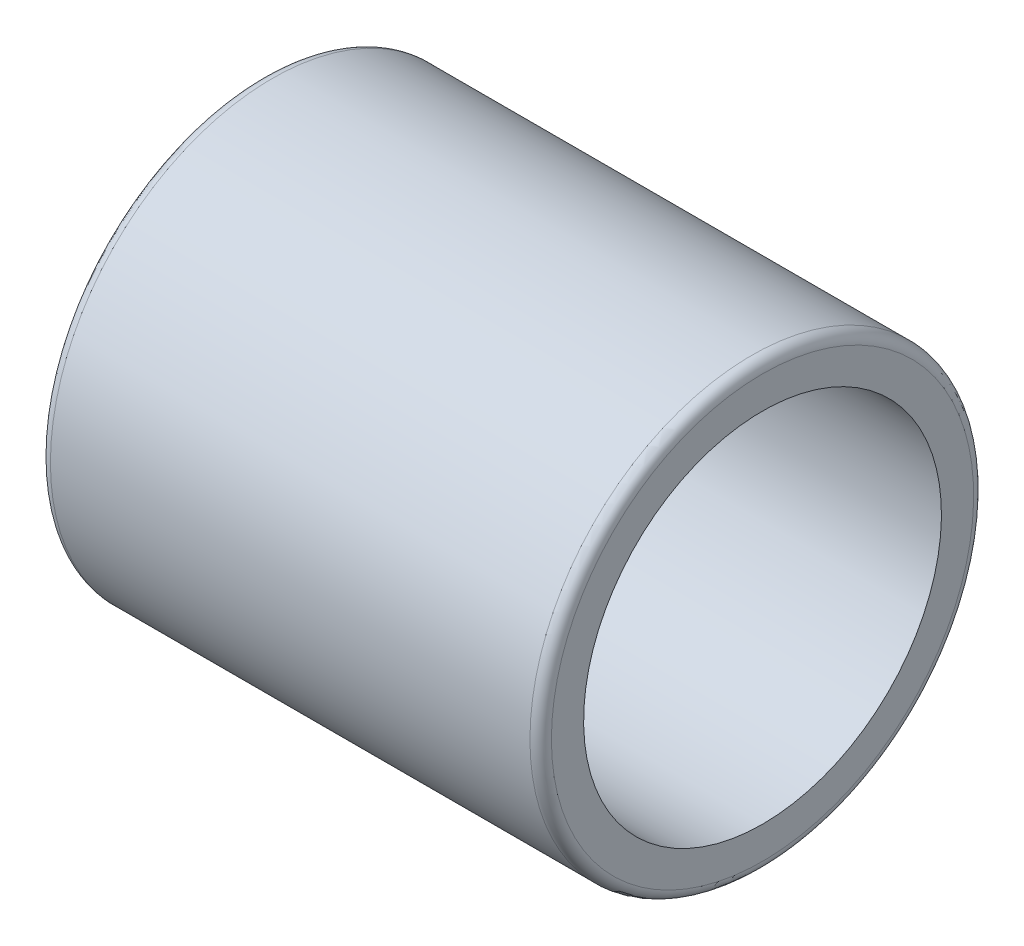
ISO-10303-21;
HEADER;
FILE_DESCRIPTION(('STEP AP214'),'2;1');
FILE_NAME('part.step','',(''),(''),'','','');
FILE_SCHEMA(('AUTOMOTIVE_DESIGN { 1 0 10303 214 1 1 1 1 }'));
ENDSEC;
DATA;
#1=APPLICATION_CONTEXT('core data for automotive mechanical design processes');
#2=APPLICATION_PROTOCOL_DEFINITION('international standard','automotive_design',2000,#1);
#3=PRODUCT_CONTEXT('',#1,'mechanical');
#4=PRODUCT('Part','Part','',(#3));
#5=PRODUCT_RELATED_PRODUCT_CATEGORY('part','',(#4));
#6=PRODUCT_DEFINITION_FORMATION('','',#4);
#7=PRODUCT_DEFINITION_CONTEXT('part definition',#1,'design');
#8=PRODUCT_DEFINITION('design','',#6,#7);
#9=PRODUCT_DEFINITION_SHAPE('','',#8);
#10=(LENGTH_UNIT() NAMED_UNIT(*) SI_UNIT(.MILLI.,.METRE.));
#11=(NAMED_UNIT(*) PLANE_ANGLE_UNIT() SI_UNIT($,.RADIAN.));
#12=(NAMED_UNIT(*) SI_UNIT($,.STERADIAN.) SOLID_ANGLE_UNIT());
#13=UNCERTAINTY_MEASURE_WITH_UNIT(LENGTH_MEASURE(1.E-05),#10,'distance_accuracy_value','');
#14=(GEOMETRIC_REPRESENTATION_CONTEXT(3) GLOBAL_UNCERTAINTY_ASSIGNED_CONTEXT((#13)) GLOBAL_UNIT_ASSIGNED_CONTEXT((#10,
#11,#12)) REPRESENTATION_CONTEXT('',''));
#15=CARTESIAN_POINT('',(0.,0.,0.));
#16=DIRECTION('',(0.,0.,1.));
#17=DIRECTION('',(1.,0.,0.));
#18=AXIS2_PLACEMENT_3D('',#15,#16,#17);
#19=CARTESIAN_POINT('',(0.,27.25,0.));
#20=DIRECTION('',(-1.,0.,0.));
#21=DIRECTION('',(0.,1.,0.));
#22=AXIS2_PLACEMENT_3D('',#19,#20,#21);
#23=PLANE('',#22);
#24=CARTESIAN_POINT('',(0.,0.,0.));
#25=DIRECTION('',(1.,0.,0.));
#26=DIRECTION('',(0.,1.,0.));
#27=AXIS2_PLACEMENT_3D('',#24,#25,#26);
#28=CIRCLE('',#27,25.);
#29=CARTESIAN_POINT('',(0.,-25.,0.));
#30=VERTEX_POINT('',#29);
#31=EDGE_CURVE('E85',#30,#30,#28,.T.);
#32=ORIENTED_EDGE('',*,*,#31,.T.);
#33=EDGE_LOOP('',(#32));
#34=FACE_BOUND('',#33,.T.);
#35=CARTESIAN_POINT('',(0.,0.,0.));
#36=DIRECTION('',(1.,0.,0.));
#37=DIRECTION('',(0.,1.,0.));
#38=AXIS2_PLACEMENT_3D('',#35,#36,#37);
#39=CIRCLE('',#38,29.5);
#40=CARTESIAN_POINT('',(0.,29.5,0.));
#41=VERTEX_POINT('',#40);
#42=CARTESIAN_POINT('',(0.,0.,29.5));
#43=VERTEX_POINT('',#42);
#44=EDGE_CURVE('E125',#41,#43,#39,.T.);
#45=ORIENTED_EDGE('',*,*,#44,.F.);
#46=CARTESIAN_POINT('',(0.,0.,0.));
#47=DIRECTION('',(1.,0.,0.));
#48=DIRECTION('',(0.,1.,0.));
#49=AXIS2_PLACEMENT_3D('',#46,#47,#48);
#50=CIRCLE('',#49,29.5);
#51=EDGE_CURVE('E120',#43,#41,#50,.T.);
#52=ORIENTED_EDGE('',*,*,#51,.F.);
#53=EDGE_LOOP('',(#45,#52));
#54=FACE_BOUND('',#53,.T.);
#55=ADVANCED_FACE('F16',(#34,#54),#23,.T.);
#56=CARTESIAN_POINT('',(70.,27.25,0.));
#57=DIRECTION('',(1.,0.,0.));
#58=DIRECTION('',(0.,1.,0.));
#59=AXIS2_PLACEMENT_3D('',#56,#57,#58);
#60=PLANE('',#59);
#61=CARTESIAN_POINT('',(70.,0.,0.));
#62=DIRECTION('',(1.,0.,0.));
#63=DIRECTION('',(0.,1.,0.));
#64=AXIS2_PLACEMENT_3D('',#61,#62,#63);
#65=CIRCLE('',#64,25.);
#66=CARTESIAN_POINT('',(70.,-25.,0.));
#67=VERTEX_POINT('',#66);
#68=EDGE_CURVE('E128',#67,#67,#65,.T.);
#69=ORIENTED_EDGE('',*,*,#68,.F.);
#70=EDGE_LOOP('',(#69));
#71=FACE_BOUND('',#70,.T.);
#72=CARTESIAN_POINT('',(70.,0.,0.));
#73=DIRECTION('',(1.,0.,0.));
#74=DIRECTION('',(0.,1.,0.));
#75=AXIS2_PLACEMENT_3D('',#72,#73,#74);
#76=CIRCLE('',#75,29.5);
#77=CARTESIAN_POINT('',(70.,29.5,0.));
#78=VERTEX_POINT('',#77);
#79=CARTESIAN_POINT('',(70.,0.,29.5));
#80=VERTEX_POINT('',#79);
#81=EDGE_CURVE('E76',#78,#80,#76,.T.);
#82=ORIENTED_EDGE('',*,*,#81,.T.);
#83=CARTESIAN_POINT('',(70.,0.,0.));
#84=DIRECTION('',(1.,0.,0.));
#85=DIRECTION('',(0.,1.,0.));
#86=AXIS2_PLACEMENT_3D('',#83,#84,#85);
#87=CIRCLE('',#86,29.5);
#88=EDGE_CURVE('E67',#80,#78,#87,.T.);
#89=ORIENTED_EDGE('',*,*,#88,.T.);
#90=EDGE_LOOP('',(#82,#89));
#91=FACE_BOUND('',#90,.T.);
#92=ADVANCED_FACE('F83',(#71,#91),#60,.T.);
#93=CARTESIAN_POINT('',(35.,0.,0.));
#94=DIRECTION('',(-1.,0.,0.));
#95=DIRECTION('',(0.,1.,0.));
#96=AXIS2_PLACEMENT_3D('',#93,#94,#95);
#97=CYLINDRICAL_SURFACE('',#96,31.);
#98=CARTESIAN_POINT('',(1.5,0.,0.));
#99=DIRECTION('',(1.,0.,0.));
#100=DIRECTION('',(0.,1.,0.));
#101=AXIS2_PLACEMENT_3D('',#98,#99,#100);
#102=CIRCLE('',#101,31.);
#103=CARTESIAN_POINT('',(1.5,-31.,0.));
#104=VERTEX_POINT('',#103);
#105=CARTESIAN_POINT('',(1.5,0.,31.));
#106=VERTEX_POINT('',#105);
#107=EDGE_CURVE('E103',#104,#106,#102,.T.);
#108=ORIENTED_EDGE('',*,*,#107,.T.);
#109=CARTESIAN_POINT('',(1.5,0.,0.));
#110=DIRECTION('',(1.,0.,0.));
#111=DIRECTION('',(0.,1.,0.));
#112=AXIS2_PLACEMENT_3D('',#109,#110,#111);
#113=CIRCLE('',#112,31.);
#114=EDGE_CURVE('E106',#106,#104,#113,.T.);
#115=ORIENTED_EDGE('',*,*,#114,.T.);
#116=DIRECTION('',(1.,0.,0.));
#117=VECTOR('',#116,1.);
#118=CARTESIAN_POINT('',(35.,-31.,0.));
#119=LINE('',#118,#117);
#120=CARTESIAN_POINT('',(68.5,-31.,0.));
#121=VERTEX_POINT('',#120);
#122=EDGE_CURVE('E10',#104,#121,#119,.T.);
#123=ORIENTED_EDGE('',*,*,#122,.T.);
#124=CARTESIAN_POINT('',(68.5,0.,0.));
#125=DIRECTION('',(1.,0.,0.));
#126=DIRECTION('',(0.,1.,0.));
#127=AXIS2_PLACEMENT_3D('',#124,#125,#126);
#128=CIRCLE('',#127,31.);
#129=CARTESIAN_POINT('',(68.5,0.,31.));
#130=VERTEX_POINT('',#129);
#131=EDGE_CURVE('E79',#130,#121,#128,.T.);
#132=ORIENTED_EDGE('',*,*,#131,.F.);
#133=CARTESIAN_POINT('',(68.5,0.,0.));
#134=DIRECTION('',(1.,0.,0.));
#135=DIRECTION('',(0.,1.,0.));
#136=AXIS2_PLACEMENT_3D('',#133,#134,#135);
#137=CIRCLE('',#136,31.);
#138=EDGE_CURVE('E25',#121,#130,#137,.T.);
#139=ORIENTED_EDGE('',*,*,#138,.F.);
#140=ORIENTED_EDGE('',*,*,#122,.F.);
#141=EDGE_LOOP('',(#108,#115,#123,#132,#139,#140));
#142=FACE_BOUND('',#141,.T.);
#143=ADVANCED_FACE('F100',(#142),#97,.T.);
#144=CARTESIAN_POINT('',(68.5,0.,0.));
#145=DIRECTION('',(1.,0.,0.));
#146=DIRECTION('',(0.,0.,-1.));
#147=AXIS2_PLACEMENT_3D('',#144,#145,#146);
#148=TOROIDAL_SURFACE('',#147,29.5,1.5);
#149=ORIENTED_EDGE('',*,*,#81,.F.);
#150=ORIENTED_EDGE('',*,*,#88,.F.);
#151=CARTESIAN_POINT('',(68.5,0.,29.5));
#152=DIRECTION('',(0.,-1.,0.));
#153=DIRECTION('',(0.,0.,1.));
#154=AXIS2_PLACEMENT_3D('',#151,#152,#153);
#155=CIRCLE('',#154,1.5);
#156=EDGE_CURVE('E74',#80,#130,#155,.T.);
#157=ORIENTED_EDGE('',*,*,#156,.T.);
#158=ORIENTED_EDGE('',*,*,#131,.T.);
#159=ORIENTED_EDGE('',*,*,#138,.T.);
#160=ORIENTED_EDGE('',*,*,#156,.F.);
#161=EDGE_LOOP('',(#149,#150,#157,#158,#159,#160));
#162=FACE_BOUND('',#161,.T.);
#163=ADVANCED_FACE('F75',(#162),#148,.T.);
#164=CARTESIAN_POINT('',(35.,0.,0.));
#165=DIRECTION('',(-1.,0.,0.));
#166=DIRECTION('',(0.,1.,0.));
#167=AXIS2_PLACEMENT_3D('',#164,#165,#166);
#168=CYLINDRICAL_SURFACE('',#167,25.);
#169=ORIENTED_EDGE('',*,*,#68,.T.);
#170=DIRECTION('',(-1.,0.,0.));
#171=VECTOR('',#170,1.);
#172=CARTESIAN_POINT('',(35.,-25.,0.));
#173=LINE('',#172,#171);
#174=EDGE_CURVE('E91',#67,#30,#173,.T.);
#175=ORIENTED_EDGE('',*,*,#174,.T.);
#176=ORIENTED_EDGE('',*,*,#31,.F.);
#177=ORIENTED_EDGE('',*,*,#174,.F.);
#178=EDGE_LOOP('',(#169,#175,#176,#177));
#179=FACE_BOUND('',#178,.T.);
#180=ADVANCED_FACE('F140',(#179),#168,.F.);
#181=CARTESIAN_POINT('',(1.5,0.,0.));
#182=DIRECTION('',(1.,0.,0.));
#183=DIRECTION('',(0.,0.,-1.));
#184=AXIS2_PLACEMENT_3D('',#181,#182,#183);
#185=TOROIDAL_SURFACE('',#184,29.5,1.5);
#186=ORIENTED_EDGE('',*,*,#107,.F.);
#187=ORIENTED_EDGE('',*,*,#114,.F.);
#188=CARTESIAN_POINT('',(1.5,0.,29.5));
#189=DIRECTION('',(0.,-1.,0.));
#190=DIRECTION('',(0.,0.,1.));
#191=AXIS2_PLACEMENT_3D('',#188,#189,#190);
#192=CIRCLE('',#191,1.5);
#193=EDGE_CURVE('E110',#106,#43,#192,.T.);
#194=ORIENTED_EDGE('',*,*,#193,.T.);
#195=ORIENTED_EDGE('',*,*,#51,.T.);
#196=ORIENTED_EDGE('',*,*,#44,.T.);
#197=ORIENTED_EDGE('',*,*,#193,.F.);
#198=EDGE_LOOP('',(#186,#187,#194,#195,#196,#197));
#199=FACE_BOUND('',#198,.T.);
#200=ADVANCED_FACE('F113',(#199),#185,.T.);
#201=CLOSED_SHELL('',(#55,#92,#143,#163,#180,#200));
#202=MANIFOLD_SOLID_BREP('B1',#201);
#203=ADVANCED_BREP_SHAPE_REPRESENTATION('',(#18,#202),#14);
#204=SHAPE_DEFINITION_REPRESENTATION(#9,#203);
ENDSEC;
END-ISO-10303-21;
